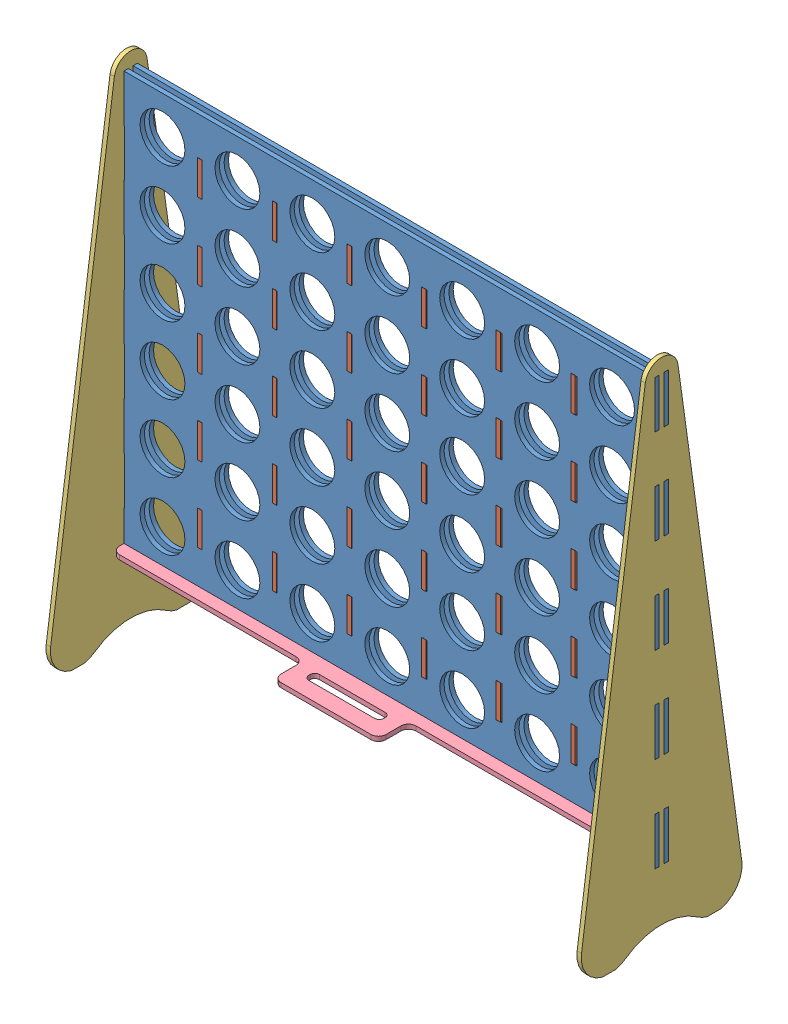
SolidWorks assembly Assemblage1.SLDASM, configuration Défaut (file format 10000). Lengths in mm.
Overall size (357.2 338.5 107.31).
11 component instances, 4 part files, 0 mates.
Components (placement in the parent):
- grille-1: grille.sldprt [Défaut] at origin size (357.2 284 2.9)
- grille-2: grille.sldprt [Défaut] at (0 0 -6.1) size (357.2 284 2.9)
- paroi interne-1: paroi interne.sldprt [Défaut] at origin size (2.9 266 9.2)
- paroi interne-2: paroi interne.sldprt [Défaut] at (49.8 0 0) size (2.9 266 9.2)
- paroi interne-3: paroi interne.sldprt [Défaut] at (99.6 0 0) size (2.9 266 9.2)
- paroi interne-4: paroi interne.sldprt [Défaut] at (149.4 0 0) size (2.9 266 9.2)
- paroi interne-5: paroi interne.sldprt [Défaut] at (199.2 0 0) size (2.9 266 9.2)
- paroi interne-6: paroi interne.sldprt [Défaut] at (249 0 0) size (2.9 266 9.2)
- pied-1: pied.sldprt [Défaut] at origin size (2.9 338.5 107.31)
- pied-2: pied.sldprt [Défaut] at (0 0 -3.2) x (-1 0 0) z (0 0 -1) size (2.9 338.5 107.31)
- tirette-1: tirette.sldprt [Défaut] at origin size (325.7 3 37)
